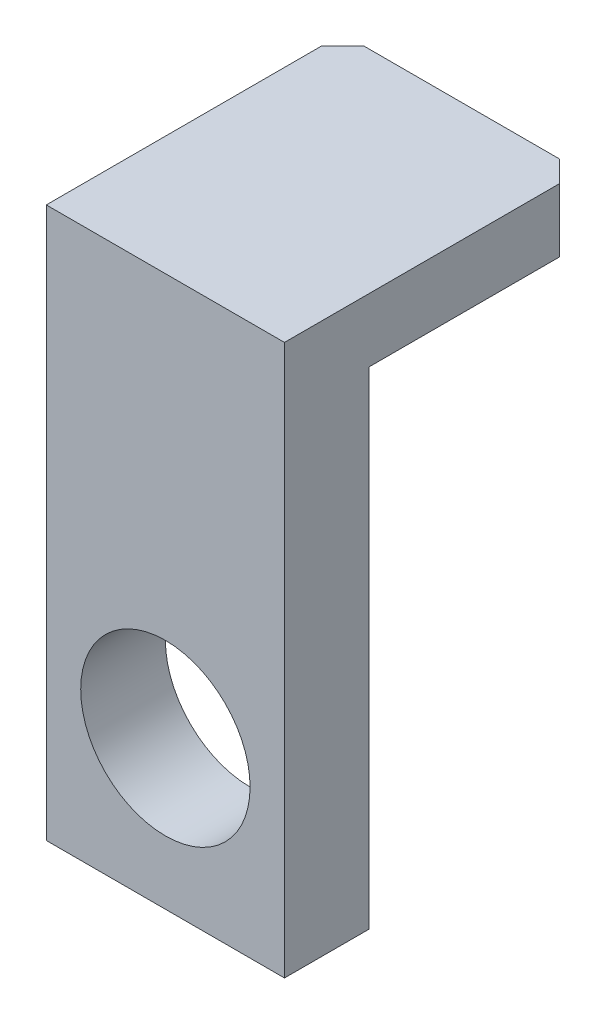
ISO-10303-21;
HEADER;
FILE_DESCRIPTION(('STEP AP214'),'2;1');
FILE_NAME('part.step','',(''),(''),'','','');
FILE_SCHEMA(('AUTOMOTIVE_DESIGN { 1 0 10303 214 1 1 1 1 }'));
ENDSEC;
DATA;
#1=APPLICATION_CONTEXT('core data for automotive mechanical design processes');
#2=APPLICATION_PROTOCOL_DEFINITION('international standard','automotive_design',2000,#1);
#3=PRODUCT_CONTEXT('',#1,'mechanical');
#4=PRODUCT('Part','Part','',(#3));
#5=PRODUCT_RELATED_PRODUCT_CATEGORY('part','',(#4));
#6=PRODUCT_DEFINITION_FORMATION('','',#4);
#7=PRODUCT_DEFINITION_CONTEXT('part definition',#1,'design');
#8=PRODUCT_DEFINITION('design','',#6,#7);
#9=PRODUCT_DEFINITION_SHAPE('','',#8);
#10=(LENGTH_UNIT() NAMED_UNIT(*) SI_UNIT(.MILLI.,.METRE.));
#11=(NAMED_UNIT(*) PLANE_ANGLE_UNIT() SI_UNIT($,.RADIAN.));
#12=(NAMED_UNIT(*) SI_UNIT($,.STERADIAN.) SOLID_ANGLE_UNIT());
#13=UNCERTAINTY_MEASURE_WITH_UNIT(LENGTH_MEASURE(1.E-05),#10,'distance_accuracy_value','');
#14=(GEOMETRIC_REPRESENTATION_CONTEXT(3) GLOBAL_UNCERTAINTY_ASSIGNED_CONTEXT((#13)) GLOBAL_UNIT_ASSIGNED_CONTEXT((#10,
#11,#12)) REPRESENTATION_CONTEXT('',''));
#15=CARTESIAN_POINT('',(0.,0.,0.));
#16=DIRECTION('',(0.,0.,1.));
#17=DIRECTION('',(1.,0.,0.));
#18=AXIS2_PLACEMENT_3D('',#15,#16,#17);
#19=CARTESIAN_POINT('',(0.,26.,4.));
#20=DIRECTION('',(0.,0.,-1.));
#21=DIRECTION('',(-1.,0.,0.));
#22=AXIS2_PLACEMENT_3D('',#19,#20,#21);
#23=PLANE('',#22);
#24=DIRECTION('',(0.,-1.,0.));
#25=VECTOR('',#24,1.);
#26=CARTESIAN_POINT('',(0.,0.,4.));
#27=LINE('',#26,#25);
#28=CARTESIAN_POINT('',(0.,26.,4.));
#29=VERTEX_POINT('',#28);
#30=CARTESIAN_POINT('',(0.,0.,4.));
#31=VERTEX_POINT('',#30);
#32=EDGE_CURVE('E137',#29,#31,#27,.T.);
#33=ORIENTED_EDGE('',*,*,#32,.T.);
#34=DIRECTION('',(1.,0.,0.));
#35=VECTOR('',#34,1.);
#36=CARTESIAN_POINT('',(0.,0.,4.));
#37=LINE('',#36,#35);
#38=CARTESIAN_POINT('',(11.25,0.,4.));
#39=VERTEX_POINT('',#38);
#40=EDGE_CURVE('E140',#31,#39,#37,.T.);
#41=ORIENTED_EDGE('',*,*,#40,.T.);
#42=DIRECTION('',(0.,1.,0.));
#43=VECTOR('',#42,1.);
#44=CARTESIAN_POINT('',(11.25,0.,4.));
#45=LINE('',#44,#43);
#46=CARTESIAN_POINT('',(11.25,26.,4.));
#47=VERTEX_POINT('',#46);
#48=EDGE_CURVE('E142',#39,#47,#45,.T.);
#49=ORIENTED_EDGE('',*,*,#48,.T.);
#50=DIRECTION('',(-1.,0.,0.));
#51=VECTOR('',#50,1.);
#52=CARTESIAN_POINT('',(0.,26.,4.));
#53=LINE('',#52,#51);
#54=EDGE_CURVE('E144',#47,#29,#53,.T.);
#55=ORIENTED_EDGE('',*,*,#54,.T.);
#56=EDGE_LOOP('',(#33,#41,#49,#55));
#57=FACE_BOUND('',#56,.T.);
#58=CARTESIAN_POINT('',(5.625,7.,4.));
#59=DIRECTION('',(0.,0.,1.));
#60=DIRECTION('',(1.,0.,0.));
#61=AXIS2_PLACEMENT_3D('',#58,#59,#60);
#62=CIRCLE('',#61,4.);
#63=CARTESIAN_POINT('',(9.625,7.,4.));
#64=VERTEX_POINT('',#63);
#65=EDGE_CURVE('E115',#64,#64,#62,.T.);
#66=ORIENTED_EDGE('',*,*,#65,.F.);
#67=EDGE_LOOP('',(#66));
#68=FACE_BOUND('',#67,.T.);
#69=ADVANCED_FACE('F33',(#57,#68),#23,.F.);
#70=CARTESIAN_POINT('',(0.,26.,0.));
#71=DIRECTION('',(0.,0.,-1.));
#72=DIRECTION('',(-1.,0.,0.));
#73=AXIS2_PLACEMENT_3D('',#70,#71,#72);
#74=PLANE('',#73);
#75=DIRECTION('',(-1.,0.,0.));
#76=VECTOR('',#75,1.);
#77=CARTESIAN_POINT('',(11.25,23.,0.));
#78=LINE('',#77,#76);
#79=CARTESIAN_POINT('',(11.25,23.,0.));
#80=VERTEX_POINT('',#79);
#81=CARTESIAN_POINT('',(0.,23.,0.));
#82=VERTEX_POINT('',#81);
#83=EDGE_CURVE('E111',#80,#82,#78,.T.);
#84=ORIENTED_EDGE('',*,*,#83,.F.);
#85=DIRECTION('',(0.,1.,0.));
#86=VECTOR('',#85,1.);
#87=CARTESIAN_POINT('',(11.25,0.,0.));
#88=LINE('',#87,#86);
#89=CARTESIAN_POINT('',(11.25,0.,0.));
#90=VERTEX_POINT('',#89);
#91=EDGE_CURVE('E125',#90,#80,#88,.T.);
#92=ORIENTED_EDGE('',*,*,#91,.F.);
#93=DIRECTION('',(1.,0.,0.));
#94=VECTOR('',#93,1.);
#95=CARTESIAN_POINT('',(0.,0.,0.));
#96=LINE('',#95,#94);
#97=CARTESIAN_POINT('',(0.,0.,0.));
#98=VERTEX_POINT('',#97);
#99=EDGE_CURVE('E113',#98,#90,#96,.T.);
#100=ORIENTED_EDGE('',*,*,#99,.F.);
#101=DIRECTION('',(0.,-1.,0.));
#102=VECTOR('',#101,1.);
#103=CARTESIAN_POINT('',(0.,0.,0.));
#104=LINE('',#103,#102);
#105=EDGE_CURVE('E99',#82,#98,#104,.T.);
#106=ORIENTED_EDGE('',*,*,#105,.F.);
#107=EDGE_LOOP('',(#84,#92,#100,#106));
#108=FACE_BOUND('',#107,.T.);
#109=CARTESIAN_POINT('',(5.625,7.,0.));
#110=DIRECTION('',(0.,0.,1.));
#111=DIRECTION('',(1.,0.,0.));
#112=AXIS2_PLACEMENT_3D('',#109,#110,#111);
#113=CIRCLE('',#112,4.);
#114=CARTESIAN_POINT('',(9.625,7.,0.));
#115=VERTEX_POINT('',#114);
#116=EDGE_CURVE('E134',#115,#115,#113,.T.);
#117=ORIENTED_EDGE('',*,*,#116,.T.);
#118=EDGE_LOOP('',(#117));
#119=FACE_BOUND('',#118,.T.);
#120=ADVANCED_FACE('F108',(#108,#119),#74,.T.);
#121=CARTESIAN_POINT('',(0.,0.,4.));
#122=DIRECTION('',(1.,0.,0.));
#123=DIRECTION('',(0.,0.,-1.));
#124=AXIS2_PLACEMENT_3D('',#121,#122,#123);
#125=PLANE('',#124);
#126=DIRECTION('',(0.,0.,-1.));
#127=VECTOR('',#126,1.);
#128=CARTESIAN_POINT('',(0.,26.,4.));
#129=LINE('',#128,#127);
#130=CARTESIAN_POINT('',(0.,26.,-9.));
#131=VERTEX_POINT('',#130);
#132=EDGE_CURVE('E146',#29,#131,#129,.T.);
#133=ORIENTED_EDGE('',*,*,#132,.T.);
#134=DIRECTION('',(0.,-1.,0.));
#135=VECTOR('',#134,1.);
#136=CARTESIAN_POINT('',(0.,23.,-9.));
#137=LINE('',#136,#135);
#138=CARTESIAN_POINT('',(0.,23.,-9.));
#139=VERTEX_POINT('',#138);
#140=EDGE_CURVE('E56',#131,#139,#137,.T.);
#141=ORIENTED_EDGE('',*,*,#140,.T.);
#142=DIRECTION('',(0.,0.,1.));
#143=VECTOR('',#142,1.);
#144=CARTESIAN_POINT('',(0.,23.,-10.));
#145=LINE('',#144,#143);
#146=EDGE_CURVE('E95',#139,#82,#145,.T.);
#147=ORIENTED_EDGE('',*,*,#146,.T.);
#148=ORIENTED_EDGE('',*,*,#105,.T.);
#149=DIRECTION('',(0.,0.,-1.));
#150=VECTOR('',#149,1.);
#151=CARTESIAN_POINT('',(0.,0.,4.));
#152=LINE('',#151,#150);
#153=EDGE_CURVE('E150',#31,#98,#152,.T.);
#154=ORIENTED_EDGE('',*,*,#153,.F.);
#155=ORIENTED_EDGE('',*,*,#32,.F.);
#156=EDGE_LOOP('',(#133,#141,#147,#148,#154,#155));
#157=FACE_BOUND('',#156,.T.);
#158=ADVANCED_FACE('F97',(#157),#125,.F.);
#159=CARTESIAN_POINT('',(0.,0.,4.));
#160=DIRECTION('',(0.,1.,0.));
#161=DIRECTION('',(-1.,0.,0.));
#162=AXIS2_PLACEMENT_3D('',#159,#160,#161);
#163=PLANE('',#162);
#164=ORIENTED_EDGE('',*,*,#99,.T.);
#165=DIRECTION('',(0.,0.,-1.));
#166=VECTOR('',#165,1.);
#167=CARTESIAN_POINT('',(11.25,0.,4.));
#168=LINE('',#167,#166);
#169=EDGE_CURVE('E153',#39,#90,#168,.T.);
#170=ORIENTED_EDGE('',*,*,#169,.F.);
#171=ORIENTED_EDGE('',*,*,#40,.F.);
#172=ORIENTED_EDGE('',*,*,#153,.T.);
#173=EDGE_LOOP('',(#164,#170,#171,#172));
#174=FACE_BOUND('',#173,.T.);
#175=ADVANCED_FACE('F195',(#174),#163,.F.);
#176=CARTESIAN_POINT('',(11.25,0.,4.));
#177=DIRECTION('',(-1.,0.,0.));
#178=DIRECTION('',(0.,-1.,0.));
#179=AXIS2_PLACEMENT_3D('',#176,#177,#178);
#180=PLANE('',#179);
#181=DIRECTION('',(0.,0.,1.));
#182=VECTOR('',#181,1.);
#183=CARTESIAN_POINT('',(11.25,23.,-10.));
#184=LINE('',#183,#182);
#185=CARTESIAN_POINT('',(11.25,23.,-9.));
#186=VERTEX_POINT('',#185);
#187=EDGE_CURVE('E103',#186,#80,#184,.T.);
#188=ORIENTED_EDGE('',*,*,#187,.F.);
#189=DIRECTION('',(0.,1.,0.));
#190=VECTOR('',#189,1.);
#191=CARTESIAN_POINT('',(11.25,26.,-9.));
#192=LINE('',#191,#190);
#193=CARTESIAN_POINT('',(11.25,26.,-8.99999999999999));
#194=VERTEX_POINT('',#193);
#195=EDGE_CURVE('E11',#186,#194,#192,.T.);
#196=ORIENTED_EDGE('',*,*,#195,.T.);
#197=DIRECTION('',(0.,0.,-1.));
#198=VECTOR('',#197,1.);
#199=CARTESIAN_POINT('',(11.25,26.,4.));
#200=LINE('',#199,#198);
#201=EDGE_CURVE('E156',#47,#194,#200,.T.);
#202=ORIENTED_EDGE('',*,*,#201,.F.);
#203=ORIENTED_EDGE('',*,*,#48,.F.);
#204=ORIENTED_EDGE('',*,*,#169,.T.);
#205=ORIENTED_EDGE('',*,*,#91,.T.);
#206=EDGE_LOOP('',(#188,#196,#202,#203,#204,#205));
#207=FACE_BOUND('',#206,.T.);
#208=ADVANCED_FACE('F191',(#207),#180,.F.);
#209=CARTESIAN_POINT('',(0.,26.,4.));
#210=DIRECTION('',(0.,-1.,0.));
#211=DIRECTION('',(0.,0.,-1.));
#212=AXIS2_PLACEMENT_3D('',#209,#210,#211);
#213=PLANE('',#212);
#214=DIRECTION('',(1.,0.,0.));
#215=VECTOR('',#214,1.);
#216=CARTESIAN_POINT('',(11.25,26.,-10.));
#217=LINE('',#216,#215);
#218=CARTESIAN_POINT('',(0.999999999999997,26.,-10.));
#219=VERTEX_POINT('',#218);
#220=CARTESIAN_POINT('',(10.25,26.,-10.));
#221=VERTEX_POINT('',#220);
#222=EDGE_CURVE('E104',#219,#221,#217,.T.);
#223=ORIENTED_EDGE('',*,*,#222,.F.);
#224=DIRECTION('',(-0.707106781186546,0.,0.707106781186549));
#225=VECTOR('',#224,1.);
#226=CARTESIAN_POINT('',(0.999999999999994,26.,-10.));
#227=LINE('',#226,#225);
#228=EDGE_CURVE('E167',#219,#131,#227,.T.);
#229=ORIENTED_EDGE('',*,*,#228,.T.);
#230=ORIENTED_EDGE('',*,*,#132,.F.);
#231=ORIENTED_EDGE('',*,*,#54,.F.);
#232=ORIENTED_EDGE('',*,*,#201,.T.);
#233=DIRECTION('',(-0.707106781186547,0.,-0.707106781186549));
#234=VECTOR('',#233,1.);
#235=CARTESIAN_POINT('',(10.25,26.,-10.));
#236=LINE('',#235,#234);
#237=EDGE_CURVE('E171',#194,#221,#236,.T.);
#238=ORIENTED_EDGE('',*,*,#237,.T.);
#239=EDGE_LOOP('',(#223,#229,#230,#231,#232,#238));
#240=FACE_BOUND('',#239,.T.);
#241=ADVANCED_FACE('F183',(#240),#213,.F.);
#242=CARTESIAN_POINT('',(5.625,7.,4.));
#243=DIRECTION('',(0.,0.,-1.));
#244=DIRECTION('',(-1.,0.,0.));
#245=AXIS2_PLACEMENT_3D('',#242,#243,#244);
#246=CYLINDRICAL_SURFACE('',#245,4.);
#247=ORIENTED_EDGE('',*,*,#65,.T.);
#248=EDGE_LOOP('',(#247));
#249=FACE_BOUND('',#248,.T.);
#250=ORIENTED_EDGE('',*,*,#116,.F.);
#251=EDGE_LOOP('',(#250));
#252=FACE_BOUND('',#251,.T.);
#253=ADVANCED_FACE('F202',(#249,#252),#246,.F.);
#254=CARTESIAN_POINT('',(11.25,23.,-10.));
#255=DIRECTION('',(0.,1.,0.));
#256=DIRECTION('',(0.,0.,1.));
#257=AXIS2_PLACEMENT_3D('',#254,#255,#256);
#258=PLANE('',#257);
#259=ORIENTED_EDGE('',*,*,#146,.F.);
#260=DIRECTION('',(0.707106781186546,0.,-0.707106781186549));
#261=VECTOR('',#260,1.);
#262=CARTESIAN_POINT('',(0.999999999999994,23.,-10.));
#263=LINE('',#262,#261);
#264=CARTESIAN_POINT('',(0.999999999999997,23.,-10.));
#265=VERTEX_POINT('',#264);
#266=EDGE_CURVE('E41',#139,#265,#263,.T.);
#267=ORIENTED_EDGE('',*,*,#266,.T.);
#268=DIRECTION('',(-1.,0.,0.));
#269=VECTOR('',#268,1.);
#270=CARTESIAN_POINT('',(11.25,23.,-10.));
#271=LINE('',#270,#269);
#272=CARTESIAN_POINT('',(10.25,23.,-10.));
#273=VERTEX_POINT('',#272);
#274=EDGE_CURVE('E118',#273,#265,#271,.T.);
#275=ORIENTED_EDGE('',*,*,#274,.F.);
#276=DIRECTION('',(0.707106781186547,0.,0.707106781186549));
#277=VECTOR('',#276,1.);
#278=CARTESIAN_POINT('',(10.25,23.,-10.));
#279=LINE('',#278,#277);
#280=EDGE_CURVE('E48',#273,#186,#279,.T.);
#281=ORIENTED_EDGE('',*,*,#280,.T.);
#282=ORIENTED_EDGE('',*,*,#187,.T.);
#283=ORIENTED_EDGE('',*,*,#83,.T.);
#284=EDGE_LOOP('',(#259,#267,#275,#281,#282,#283));
#285=FACE_BOUND('',#284,.T.);
#286=ADVANCED_FACE('F117',(#285),#258,.F.);
#287=CARTESIAN_POINT('',(11.25,23.,-10.));
#288=DIRECTION('',(0.,0.,-1.));
#289=DIRECTION('',(-1.,0.,0.));
#290=AXIS2_PLACEMENT_3D('',#287,#288,#289);
#291=PLANE('',#290);
#292=ORIENTED_EDGE('',*,*,#274,.T.);
#293=DIRECTION('',(0.,1.,0.));
#294=VECTOR('',#293,1.);
#295=CARTESIAN_POINT('',(0.999999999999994,26.,-10.));
#296=LINE('',#295,#294);
#297=EDGE_CURVE('E178',#265,#219,#296,.T.);
#298=ORIENTED_EDGE('',*,*,#297,.T.);
#299=ORIENTED_EDGE('',*,*,#222,.T.);
#300=DIRECTION('',(0.,-1.,0.));
#301=VECTOR('',#300,1.);
#302=CARTESIAN_POINT('',(10.25,23.,-10.));
#303=LINE('',#302,#301);
#304=EDGE_CURVE('E152',#221,#273,#303,.T.);
#305=ORIENTED_EDGE('',*,*,#304,.T.);
#306=EDGE_LOOP('',(#292,#298,#299,#305));
#307=FACE_BOUND('',#306,.T.);
#308=ADVANCED_FACE('F189',(#307),#291,.T.);
#309=CARTESIAN_POINT('',(0.999999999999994,23.,-10.));
#310=DIRECTION('',(-0.707106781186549,0.,-0.707106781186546));
#311=DIRECTION('',(-0.707106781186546,0.,0.707106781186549));
#312=AXIS2_PLACEMENT_3D('',#309,#310,#311);
#313=PLANE('',#312);
#314=ORIENTED_EDGE('',*,*,#266,.F.);
#315=ORIENTED_EDGE('',*,*,#140,.F.);
#316=ORIENTED_EDGE('',*,*,#228,.F.);
#317=ORIENTED_EDGE('',*,*,#297,.F.);
#318=EDGE_LOOP('',(#314,#315,#316,#317));
#319=FACE_BOUND('',#318,.T.);
#320=ADVANCED_FACE('F165',(#319),#313,.T.);
#321=CARTESIAN_POINT('',(10.25,23.,-10.));
#322=DIRECTION('',(0.707106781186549,0.,-0.707106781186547));
#323=DIRECTION('',(-0.707106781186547,0.,-0.707106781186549));
#324=AXIS2_PLACEMENT_3D('',#321,#322,#323);
#325=PLANE('',#324);
#326=ORIENTED_EDGE('',*,*,#237,.F.);
#327=ORIENTED_EDGE('',*,*,#195,.F.);
#328=ORIENTED_EDGE('',*,*,#280,.F.);
#329=ORIENTED_EDGE('',*,*,#304,.F.);
#330=EDGE_LOOP('',(#326,#327,#328,#329));
#331=FACE_BOUND('',#330,.T.);
#332=ADVANCED_FACE('F35',(#331),#325,.T.);
#333=CLOSED_SHELL('',(#69,#120,#158,#175,#208,#241,#253,#286,#308,#320,#332));
#334=MANIFOLD_SOLID_BREP('B2',#333);
#335=ADVANCED_BREP_SHAPE_REPRESENTATION('',(#18,#334),#14);
#336=SHAPE_DEFINITION_REPRESENTATION(#9,#335);
ENDSEC;
END-ISO-10303-21;
